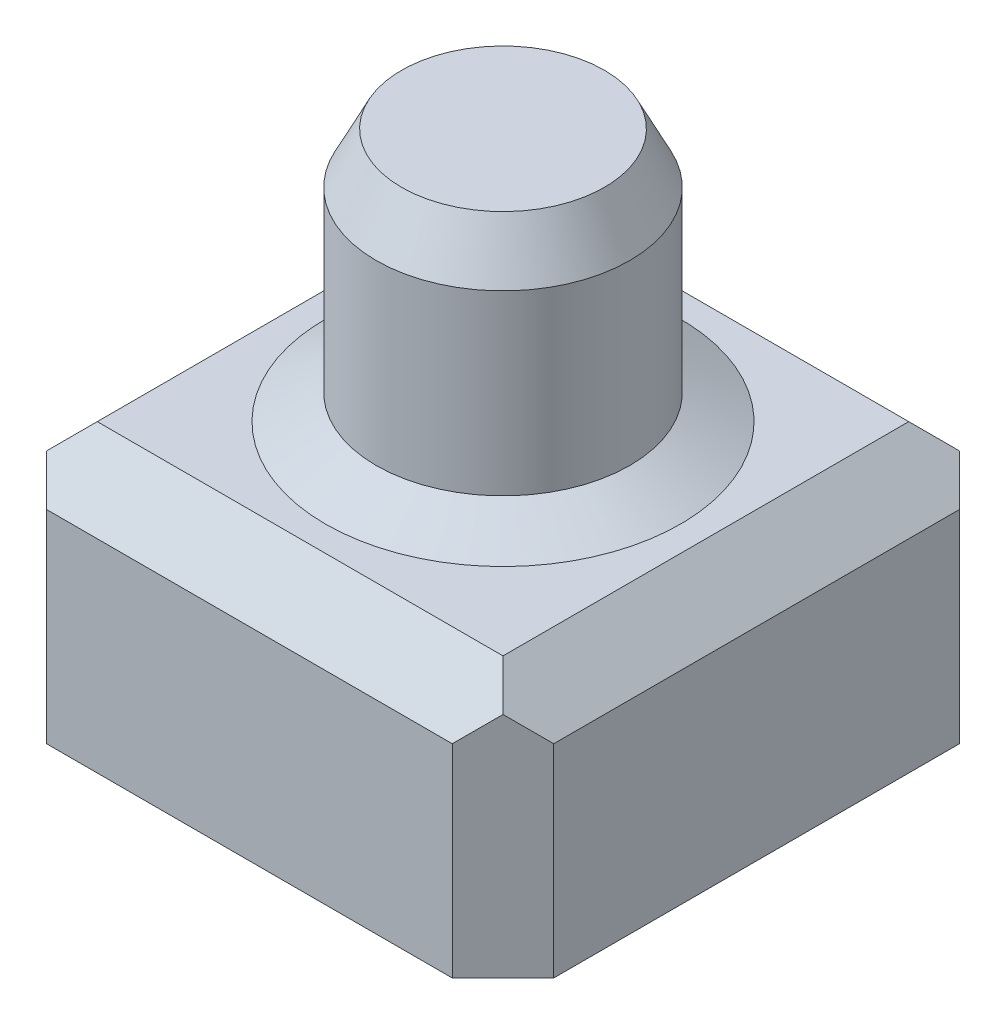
ISO-10303-21;
HEADER;
FILE_DESCRIPTION(('STEP AP214'),'2;1');
FILE_NAME('part.step','',(''),(''),'','','');
FILE_SCHEMA(('AUTOMOTIVE_DESIGN { 1 0 10303 214 1 1 1 1 }'));
ENDSEC;
DATA;
#1=APPLICATION_CONTEXT('core data for automotive mechanical design processes');
#2=APPLICATION_PROTOCOL_DEFINITION('international standard','automotive_design',2000,#1);
#3=PRODUCT_CONTEXT('',#1,'mechanical');
#4=PRODUCT('Part','Part','',(#3));
#5=PRODUCT_RELATED_PRODUCT_CATEGORY('part','',(#4));
#6=PRODUCT_DEFINITION_FORMATION('','',#4);
#7=PRODUCT_DEFINITION_CONTEXT('part definition',#1,'design');
#8=PRODUCT_DEFINITION('design','',#6,#7);
#9=PRODUCT_DEFINITION_SHAPE('','',#8);
#10=(LENGTH_UNIT() NAMED_UNIT(*) SI_UNIT(.MILLI.,.METRE.));
#11=(NAMED_UNIT(*) PLANE_ANGLE_UNIT() SI_UNIT($,.RADIAN.));
#12=(NAMED_UNIT(*) SI_UNIT($,.STERADIAN.) SOLID_ANGLE_UNIT());
#13=UNCERTAINTY_MEASURE_WITH_UNIT(LENGTH_MEASURE(1.E-05),#10,'distance_accuracy_value','');
#14=(GEOMETRIC_REPRESENTATION_CONTEXT(3) GLOBAL_UNCERTAINTY_ASSIGNED_CONTEXT((#13)) GLOBAL_UNIT_ASSIGNED_CONTEXT((#10,
#11,#12)) REPRESENTATION_CONTEXT('',''));
#15=CARTESIAN_POINT('',(0.,0.,0.));
#16=DIRECTION('',(0.,0.,1.));
#17=DIRECTION('',(1.,0.,0.));
#18=AXIS2_PLACEMENT_3D('',#15,#16,#17);
#19=CARTESIAN_POINT('',(0.,50.,0.));
#20=DIRECTION('',(0.,1.,0.));
#21=DIRECTION('',(0.,0.,1.));
#22=AXIS2_PLACEMENT_3D('',#19,#20,#21);
#23=PLANE('',#22);
#24=DIRECTION('',(-1.,0.,0.));
#25=VECTOR('',#24,1.);
#26=CARTESIAN_POINT('',(-89.9999999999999,50.,-90.));
#27=LINE('',#26,#25);
#28=CARTESIAN_POINT('',(-10.,50.,-90.));
#29=VERTEX_POINT('',#28);
#30=CARTESIAN_POINT('',(-90.,50.,-90.));
#31=VERTEX_POINT('',#30);
#32=EDGE_CURVE('E191',#29,#31,#27,.T.);
#33=ORIENTED_EDGE('',*,*,#32,.T.);
#34=DIRECTION('',(0.,0.,1.));
#35=VECTOR('',#34,1.);
#36=CARTESIAN_POINT('',(-90.,50.,-10.0000000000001));
#37=LINE('',#36,#35);
#38=CARTESIAN_POINT('',(-90.,50.,-10.));
#39=VERTEX_POINT('',#38);
#40=EDGE_CURVE('E193',#31,#39,#37,.T.);
#41=ORIENTED_EDGE('',*,*,#40,.T.);
#42=DIRECTION('',(1.,0.,0.));
#43=VECTOR('',#42,1.);
#44=CARTESIAN_POINT('',(-10.,50.,-10.));
#45=LINE('',#44,#43);
#46=CARTESIAN_POINT('',(-10.,50.,-10.));
#47=VERTEX_POINT('',#46);
#48=EDGE_CURVE('E187',#39,#47,#45,.T.);
#49=ORIENTED_EDGE('',*,*,#48,.T.);
#50=DIRECTION('',(0.,0.,-1.));
#51=VECTOR('',#50,1.);
#52=CARTESIAN_POINT('',(-10.,50.,-90.));
#53=LINE('',#52,#51);
#54=EDGE_CURVE('E189',#47,#29,#53,.T.);
#55=ORIENTED_EDGE('',*,*,#54,.T.);
#56=EDGE_LOOP('',(#33,#41,#49,#55));
#57=FACE_BOUND('',#56,.T.);
#58=CARTESIAN_POINT('',(-50.,50.,-50.));
#59=DIRECTION('',(0.,1.,0.));
#60=DIRECTION('',(0.,0.,1.));
#61=AXIS2_PLACEMENT_3D('',#58,#59,#60);
#62=CIRCLE('',#61,34.9999999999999);
#63=CARTESIAN_POINT('',(-50.,50.,-15.0000000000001));
#64=VERTEX_POINT('',#63);
#65=EDGE_CURVE('E181',#64,#64,#62,.F.);
#66=ORIENTED_EDGE('',*,*,#65,.T.);
#67=EDGE_LOOP('',(#66));
#68=FACE_BOUND('',#67,.T.);
#69=ADVANCED_FACE('F33',(#57,#68),#23,.T.);
#70=CARTESIAN_POINT('',(0.,50.,0.));
#71=DIRECTION('',(-1.,0.,0.));
#72=DIRECTION('',(0.,0.,1.));
#73=AXIS2_PLACEMENT_3D('',#70,#71,#72);
#74=PLANE('',#73);
#75=DIRECTION('',(0.,1.,0.));
#76=VECTOR('',#75,1.);
#77=CARTESIAN_POINT('',(0.,50.,-90.));
#78=LINE('',#77,#76);
#79=CARTESIAN_POINT('',(0.,0.,-90.));
#80=VERTEX_POINT('',#79);
#81=CARTESIAN_POINT('',(0.,40.,-90.));
#82=VERTEX_POINT('',#81);
#83=EDGE_CURVE('E129',#80,#82,#78,.T.);
#84=ORIENTED_EDGE('',*,*,#83,.T.);
#85=DIRECTION('',(0.,0.,1.));
#86=VECTOR('',#85,1.);
#87=CARTESIAN_POINT('',(0.,40.,-9.99999999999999));
#88=LINE('',#87,#86);
#89=CARTESIAN_POINT('',(0.,40.,-9.99999999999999));
#90=VERTEX_POINT('',#89);
#91=EDGE_CURVE('E127',#82,#90,#88,.T.);
#92=ORIENTED_EDGE('',*,*,#91,.T.);
#93=DIRECTION('',(0.,-1.,0.));
#94=VECTOR('',#93,1.);
#95=CARTESIAN_POINT('',(0.,50.,-9.99999999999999));
#96=LINE('',#95,#94);
#97=CARTESIAN_POINT('',(0.,0.,-9.99999999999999));
#98=VERTEX_POINT('',#97);
#99=EDGE_CURVE('E120',#90,#98,#96,.T.);
#100=ORIENTED_EDGE('',*,*,#99,.T.);
#101=DIRECTION('',(0.,0.,-1.));
#102=VECTOR('',#101,1.);
#103=CARTESIAN_POINT('',(0.,0.,0.));
#104=LINE('',#103,#102);
#105=EDGE_CURVE('E124',#98,#80,#104,.T.);
#106=ORIENTED_EDGE('',*,*,#105,.T.);
#107=EDGE_LOOP('',(#84,#92,#100,#106));
#108=FACE_BOUND('',#107,.T.);
#109=ADVANCED_FACE('F35',(#108),#74,.F.);
#110=CARTESIAN_POINT('',(0.,50.,-100.));
#111=DIRECTION('',(0.,0.,1.));
#112=DIRECTION('',(1.,0.,0.));
#113=AXIS2_PLACEMENT_3D('',#110,#111,#112);
#114=PLANE('',#113);
#115=DIRECTION('',(0.,1.,0.));
#116=VECTOR('',#115,1.);
#117=CARTESIAN_POINT('',(-90.,50.,-100.));
#118=LINE('',#117,#116);
#119=CARTESIAN_POINT('',(-90.,0.,-100.));
#120=VERTEX_POINT('',#119);
#121=CARTESIAN_POINT('',(-90.,40.,-100.));
#122=VERTEX_POINT('',#121);
#123=EDGE_CURVE('E165',#120,#122,#118,.T.);
#124=ORIENTED_EDGE('',*,*,#123,.T.);
#125=DIRECTION('',(1.,0.,0.));
#126=VECTOR('',#125,1.);
#127=CARTESIAN_POINT('',(-9.99999999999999,40.,-100.));
#128=LINE('',#127,#126);
#129=CARTESIAN_POINT('',(-9.99999999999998,40.,-100.));
#130=VERTEX_POINT('',#129);
#131=EDGE_CURVE('E207',#122,#130,#128,.T.);
#132=ORIENTED_EDGE('',*,*,#131,.T.);
#133=DIRECTION('',(0.,-1.,0.));
#134=VECTOR('',#133,1.);
#135=CARTESIAN_POINT('',(-9.99999999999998,50.,-100.));
#136=LINE('',#135,#134);
#137=CARTESIAN_POINT('',(-9.99999999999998,0.,-100.));
#138=VERTEX_POINT('',#137);
#139=EDGE_CURVE('E168',#130,#138,#136,.T.);
#140=ORIENTED_EDGE('',*,*,#139,.T.);
#141=DIRECTION('',(-1.,0.,0.));
#142=VECTOR('',#141,1.);
#143=CARTESIAN_POINT('',(0.,0.,-100.));
#144=LINE('',#143,#142);
#145=EDGE_CURVE('E143',#138,#120,#144,.T.);
#146=ORIENTED_EDGE('',*,*,#145,.T.);
#147=EDGE_LOOP('',(#124,#132,#140,#146));
#148=FACE_BOUND('',#147,.T.);
#149=ADVANCED_FACE('F264',(#148),#114,.F.);
#150=CARTESIAN_POINT('',(-100.,50.,0.));
#151=DIRECTION('',(1.,0.,0.));
#152=DIRECTION('',(0.,0.,-1.));
#153=AXIS2_PLACEMENT_3D('',#150,#151,#152);
#154=PLANE('',#153);
#155=DIRECTION('',(0.,1.,0.));
#156=VECTOR('',#155,1.);
#157=CARTESIAN_POINT('',(-100.,50.,-10.0000000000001));
#158=LINE('',#157,#156);
#159=CARTESIAN_POINT('',(-100.,0.,-10.0000000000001));
#160=VERTEX_POINT('',#159);
#161=CARTESIAN_POINT('',(-100.,40.,-10.0000000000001));
#162=VERTEX_POINT('',#161);
#163=EDGE_CURVE('E170',#160,#162,#158,.T.);
#164=ORIENTED_EDGE('',*,*,#163,.T.);
#165=DIRECTION('',(0.,0.,-1.));
#166=VECTOR('',#165,1.);
#167=CARTESIAN_POINT('',(-100.,40.,-90.));
#168=LINE('',#167,#166);
#169=CARTESIAN_POINT('',(-100.,40.,-90.));
#170=VERTEX_POINT('',#169);
#171=EDGE_CURVE('E200',#162,#170,#168,.T.);
#172=ORIENTED_EDGE('',*,*,#171,.T.);
#173=DIRECTION('',(0.,-1.,0.));
#174=VECTOR('',#173,1.);
#175=CARTESIAN_POINT('',(-100.,50.,-90.));
#176=LINE('',#175,#174);
#177=CARTESIAN_POINT('',(-100.,0.,-90.));
#178=VERTEX_POINT('',#177);
#179=EDGE_CURVE('E173',#170,#178,#176,.T.);
#180=ORIENTED_EDGE('',*,*,#179,.T.);
#181=DIRECTION('',(0.,0.,1.));
#182=VECTOR('',#181,1.);
#183=CARTESIAN_POINT('',(-100.,0.,0.));
#184=LINE('',#183,#182);
#185=EDGE_CURVE('E147',#178,#160,#184,.T.);
#186=ORIENTED_EDGE('',*,*,#185,.T.);
#187=EDGE_LOOP('',(#164,#172,#180,#186));
#188=FACE_BOUND('',#187,.T.);
#189=ADVANCED_FACE('F257',(#188),#154,.F.);
#190=CARTESIAN_POINT('',(0.,50.,0.));
#191=DIRECTION('',(0.,0.,-1.));
#192=DIRECTION('',(-1.,0.,0.));
#193=AXIS2_PLACEMENT_3D('',#190,#191,#192);
#194=PLANE('',#193);
#195=DIRECTION('',(0.,1.,0.));
#196=VECTOR('',#195,1.);
#197=CARTESIAN_POINT('',(-10.,50.,0.));
#198=LINE('',#197,#196);
#199=CARTESIAN_POINT('',(-10.,0.,0.));
#200=VERTEX_POINT('',#199);
#201=CARTESIAN_POINT('',(-10.,40.,0.));
#202=VERTEX_POINT('',#201);
#203=EDGE_CURVE('E133',#200,#202,#198,.T.);
#204=ORIENTED_EDGE('',*,*,#203,.T.);
#205=DIRECTION('',(-1.,0.,0.));
#206=VECTOR('',#205,1.);
#207=CARTESIAN_POINT('',(-90.,40.,0.));
#208=LINE('',#207,#206);
#209=CARTESIAN_POINT('',(-90.,40.,0.));
#210=VERTEX_POINT('',#209);
#211=EDGE_CURVE('E11',#202,#210,#208,.T.);
#212=ORIENTED_EDGE('',*,*,#211,.T.);
#213=DIRECTION('',(0.,-1.,0.));
#214=VECTOR('',#213,1.);
#215=CARTESIAN_POINT('',(-90.,50.,0.));
#216=LINE('',#215,#214);
#217=CARTESIAN_POINT('',(-90.,0.,0.));
#218=VERTEX_POINT('',#217);
#219=EDGE_CURVE('E137',#210,#218,#216,.T.);
#220=ORIENTED_EDGE('',*,*,#219,.T.);
#221=DIRECTION('',(1.,0.,0.));
#222=VECTOR('',#221,1.);
#223=CARTESIAN_POINT('',(0.,0.,0.));
#224=LINE('',#223,#222);
#225=EDGE_CURVE('E156',#218,#200,#224,.T.);
#226=ORIENTED_EDGE('',*,*,#225,.T.);
#227=EDGE_LOOP('',(#204,#212,#220,#226));
#228=FACE_BOUND('',#227,.T.);
#229=ADVANCED_FACE('F254',(#228),#194,.F.);
#230=CARTESIAN_POINT('',(0.,0.,0.));
#231=DIRECTION('',(0.,1.,0.));
#232=DIRECTION('',(0.,0.,1.));
#233=AXIS2_PLACEMENT_3D('',#230,#231,#232);
#234=PLANE('',#233);
#235=ORIENTED_EDGE('',*,*,#105,.F.);
#236=DIRECTION('',(0.707106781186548,0.,-0.707106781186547));
#237=VECTOR('',#236,1.);
#238=CARTESIAN_POINT('',(0.,0.,-9.99999999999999));
#239=LINE('',#238,#237);
#240=EDGE_CURVE('E131',#98,#200,#239,.F.);
#241=ORIENTED_EDGE('',*,*,#240,.T.);
#242=ORIENTED_EDGE('',*,*,#225,.F.);
#243=DIRECTION('',(0.707106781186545,0.,0.70710678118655));
#244=VECTOR('',#243,1.);
#245=CARTESIAN_POINT('',(-90.,0.,0.));
#246=LINE('',#245,#244);
#247=EDGE_CURVE('E128',#218,#160,#246,.F.);
#248=ORIENTED_EDGE('',*,*,#247,.T.);
#249=ORIENTED_EDGE('',*,*,#185,.F.);
#250=DIRECTION('',(-0.707106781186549,0.,0.707106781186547));
#251=VECTOR('',#250,1.);
#252=CARTESIAN_POINT('',(-100.,0.,-90.));
#253=LINE('',#252,#251);
#254=EDGE_CURVE('E160',#178,#120,#253,.F.);
#255=ORIENTED_EDGE('',*,*,#254,.T.);
#256=ORIENTED_EDGE('',*,*,#145,.F.);
#257=DIRECTION('',(-0.707106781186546,0.,-0.707106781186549));
#258=VECTOR('',#257,1.);
#259=CARTESIAN_POINT('',(-9.99999999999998,0.,-100.));
#260=LINE('',#259,#258);
#261=EDGE_CURVE('E138',#138,#80,#260,.F.);
#262=ORIENTED_EDGE('',*,*,#261,.T.);
#263=EDGE_LOOP('',(#235,#241,#242,#248,#249,#255,#256,#262));
#264=FACE_BOUND('',#263,.T.);
#265=ADVANCED_FACE('F140',(#264),#234,.F.);
#266=CARTESIAN_POINT('',(-50.,100.,-50.));
#267=DIRECTION('',(0.,-1.,0.));
#268=DIRECTION('',(0.,0.,-1.));
#269=AXIS2_PLACEMENT_3D('',#266,#267,#268);
#270=CYLINDRICAL_SURFACE('',#269,25.);
#271=CARTESIAN_POINT('',(-50.,55.,-50.));
#272=DIRECTION('',(0.,1.,0.));
#273=DIRECTION('',(0.,0.,1.));
#274=AXIS2_PLACEMENT_3D('',#271,#272,#273);
#275=CIRCLE('',#274,25.);
#276=CARTESIAN_POINT('',(-50.,55.,-25.));
#277=VERTEX_POINT('',#276);
#278=EDGE_CURVE('E178',#277,#277,#275,.T.);
#279=ORIENTED_EDGE('',*,*,#278,.T.);
#280=EDGE_LOOP('',(#279));
#281=FACE_BOUND('',#280,.T.);
#282=CARTESIAN_POINT('',(-50.,89.9999999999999,-50.));
#283=DIRECTION('',(0.,1.,0.));
#284=DIRECTION('',(0.,0.,1.));
#285=AXIS2_PLACEMENT_3D('',#282,#283,#284);
#286=CIRCLE('',#285,25.);
#287=CARTESIAN_POINT('',(-50.,89.9999999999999,-75.));
#288=VERTEX_POINT('',#287);
#289=EDGE_CURVE('E175',#288,#288,#286,.F.);
#290=ORIENTED_EDGE('',*,*,#289,.T.);
#291=EDGE_LOOP('',(#290));
#292=FACE_BOUND('',#291,.T.);
#293=ADVANCED_FACE('F282',(#281,#292),#270,.T.);
#294=CARTESIAN_POINT('',(-50.,100.,-50.));
#295=DIRECTION('',(0.,1.,0.));
#296=DIRECTION('',(0.,0.,1.));
#297=AXIS2_PLACEMENT_3D('',#294,#295,#296);
#298=PLANE('',#297);
#299=CARTESIAN_POINT('',(-50.,100.,-50.));
#300=DIRECTION('',(0.,1.,0.));
#301=DIRECTION('',(0.,0.,1.));
#302=AXIS2_PLACEMENT_3D('',#299,#300,#301);
#303=CIRCLE('',#302,20.);
#304=CARTESIAN_POINT('',(-50.,100.,-70.));
#305=VERTEX_POINT('',#304);
#306=EDGE_CURVE('E184',#305,#305,#303,.T.);
#307=ORIENTED_EDGE('',*,*,#306,.T.);
#308=EDGE_LOOP('',(#307));
#309=FACE_BOUND('',#308,.T.);
#310=ADVANCED_FACE('F286',(#309),#298,.T.);
#311=CARTESIAN_POINT('',(0.,50.,-9.99999999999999));
#312=DIRECTION('',(-0.707106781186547,0.,-0.707106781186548));
#313=DIRECTION('',(-0.707106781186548,0.,0.707106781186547));
#314=AXIS2_PLACEMENT_3D('',#311,#312,#313);
#315=PLANE('',#314);
#316=ORIENTED_EDGE('',*,*,#99,.F.);
#317=DIRECTION('',(0.577350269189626,-0.577350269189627,-0.577350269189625));
#318=VECTOR('',#317,1.);
#319=CARTESIAN_POINT('',(-3.33333333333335,43.3333333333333,-6.66666666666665));
#320=LINE('',#319,#318);
#321=CARTESIAN_POINT('',(-5.,45.,-5.));
#322=VERTEX_POINT('',#321);
#323=EDGE_CURVE('E41',#90,#322,#320,.F.);
#324=ORIENTED_EDGE('',*,*,#323,.T.);
#325=DIRECTION('',(0.577350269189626,0.577350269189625,-0.577350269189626));
#326=VECTOR('',#325,1.);
#327=CARTESIAN_POINT('',(0.,50.,-10.));
#328=LINE('',#327,#326);
#329=EDGE_CURVE('E52',#322,#202,#328,.F.);
#330=ORIENTED_EDGE('',*,*,#329,.T.);
#331=ORIENTED_EDGE('',*,*,#203,.F.);
#332=ORIENTED_EDGE('',*,*,#240,.F.);
#333=EDGE_LOOP('',(#316,#324,#330,#331,#332));
#334=FACE_BOUND('',#333,.T.);
#335=ADVANCED_FACE('F132',(#334),#315,.F.);
#336=CARTESIAN_POINT('',(-9.99999999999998,50.,-100.));
#337=DIRECTION('',(-0.707106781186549,0.,0.707106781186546));
#338=DIRECTION('',(0.707106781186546,0.,0.707106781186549));
#339=AXIS2_PLACEMENT_3D('',#336,#337,#338);
#340=PLANE('',#339);
#341=ORIENTED_EDGE('',*,*,#139,.F.);
#342=DIRECTION('',(-0.577350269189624,-0.577350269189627,-0.577350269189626));
#343=VECTOR('',#342,1.);
#344=CARTESIAN_POINT('',(-6.66666666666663,43.3333333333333,-96.6666666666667));
#345=LINE('',#344,#343);
#346=CARTESIAN_POINT('',(-4.99999999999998,45.,-95.));
#347=VERTEX_POINT('',#346);
#348=EDGE_CURVE('E211',#130,#347,#345,.F.);
#349=ORIENTED_EDGE('',*,*,#348,.T.);
#350=DIRECTION('',(-0.577350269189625,0.577350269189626,-0.577350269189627));
#351=VECTOR('',#350,1.);
#352=CARTESIAN_POINT('',(-9.99999999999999,50.,-100.));
#353=LINE('',#352,#351);
#354=EDGE_CURVE('E209',#347,#82,#353,.F.);
#355=ORIENTED_EDGE('',*,*,#354,.T.);
#356=ORIENTED_EDGE('',*,*,#83,.F.);
#357=ORIENTED_EDGE('',*,*,#261,.F.);
#358=EDGE_LOOP('',(#341,#349,#355,#356,#357));
#359=FACE_BOUND('',#358,.T.);
#360=ADVANCED_FACE('F218',(#359),#340,.F.);
#361=CARTESIAN_POINT('',(-100.,50.,-90.));
#362=DIRECTION('',(0.707106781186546,0.,0.707106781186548));
#363=DIRECTION('',(0.707106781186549,0.,-0.707106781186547));
#364=AXIS2_PLACEMENT_3D('',#361,#362,#363);
#365=PLANE('',#364);
#366=ORIENTED_EDGE('',*,*,#179,.F.);
#367=DIRECTION('',(-0.577350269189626,-0.577350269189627,0.577350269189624));
#368=VECTOR('',#367,1.);
#369=CARTESIAN_POINT('',(-96.6666666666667,43.3333333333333,-93.3333333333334));
#370=LINE('',#369,#368);
#371=CARTESIAN_POINT('',(-95.,45.,-95.));
#372=VERTEX_POINT('',#371);
#373=EDGE_CURVE('E205',#170,#372,#370,.F.);
#374=ORIENTED_EDGE('',*,*,#373,.T.);
#375=DIRECTION('',(-0.577350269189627,0.577350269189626,0.577350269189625));
#376=VECTOR('',#375,1.);
#377=CARTESIAN_POINT('',(-100.,50.,-90.));
#378=LINE('',#377,#376);
#379=EDGE_CURVE('E203',#372,#122,#378,.F.);
#380=ORIENTED_EDGE('',*,*,#379,.T.);
#381=ORIENTED_EDGE('',*,*,#123,.F.);
#382=ORIENTED_EDGE('',*,*,#254,.F.);
#383=EDGE_LOOP('',(#366,#374,#380,#381,#382));
#384=FACE_BOUND('',#383,.T.);
#385=ADVANCED_FACE('F262',(#384),#365,.F.);
#386=CARTESIAN_POINT('',(-90.,50.,0.));
#387=DIRECTION('',(0.70710678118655,0.,-0.707106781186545));
#388=DIRECTION('',(-0.707106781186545,0.,-0.70710678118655));
#389=AXIS2_PLACEMENT_3D('',#386,#387,#388);
#390=PLANE('',#389);
#391=DIRECTION('',(0.577350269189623,-0.577350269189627,0.577350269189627));
#392=VECTOR('',#391,1.);
#393=CARTESIAN_POINT('',(-93.3333333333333,43.3333333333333,-3.33333333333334));
#394=LINE('',#393,#392);
#395=CARTESIAN_POINT('',(-95.,45.,-4.99999999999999));
#396=VERTEX_POINT('',#395);
#397=EDGE_CURVE('E196',#210,#396,#394,.F.);
#398=ORIENTED_EDGE('',*,*,#397,.T.);
#399=DIRECTION('',(0.577350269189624,0.577350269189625,0.577350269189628));
#400=VECTOR('',#399,1.);
#401=CARTESIAN_POINT('',(-90.,50.,0.));
#402=LINE('',#401,#400);
#403=EDGE_CURVE('E198',#396,#162,#402,.F.);
#404=ORIENTED_EDGE('',*,*,#403,.T.);
#405=ORIENTED_EDGE('',*,*,#163,.F.);
#406=ORIENTED_EDGE('',*,*,#247,.F.);
#407=ORIENTED_EDGE('',*,*,#219,.F.);
#408=EDGE_LOOP('',(#398,#404,#405,#406,#407));
#409=FACE_BOUND('',#408,.T.);
#410=ADVANCED_FACE('F250',(#409),#390,.F.);
#411=CARTESIAN_POINT('',(-50.,55.,-50.));
#412=DIRECTION('',(0.,-1.,0.));
#413=DIRECTION('',(0.,0.,-1.));
#414=AXIS2_PLACEMENT_3D('',#411,#412,#413);
#415=CONICAL_SURFACE('',#414,25.,1.10714871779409);
#416=ORIENTED_EDGE('',*,*,#65,.F.);
#417=EDGE_LOOP('',(#416));
#418=FACE_BOUND('',#417,.T.);
#419=ORIENTED_EDGE('',*,*,#278,.F.);
#420=EDGE_LOOP('',(#419));
#421=FACE_BOUND('',#420,.T.);
#422=ADVANCED_FACE('F303',(#418,#421),#415,.T.);
#423=CARTESIAN_POINT('',(-50.,100.,-50.));
#424=DIRECTION('',(0.,-1.,0.));
#425=DIRECTION('',(0.,0.,-1.));
#426=AXIS2_PLACEMENT_3D('',#423,#424,#425);
#427=CONICAL_SURFACE('',#426,20.,0.463647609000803);
#428=CARTESIAN_POINT('',(-50.,89.9999999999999,-75.));
#429=CARTESIAN_POINT('',(-50.,90.1041666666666,-74.9479166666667));
#430=CARTESIAN_POINT('',(-50.,90.2083333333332,-74.8958333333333));
#431=CARTESIAN_POINT('',(-50.,90.4166666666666,-74.7916666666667));
#432=CARTESIAN_POINT('',(-50.,90.5208333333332,-74.7395833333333));
#433=CARTESIAN_POINT('',(-50.,90.7291666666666,-74.6354166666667));
#434=CARTESIAN_POINT('',(-50.,90.8333333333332,-74.5833333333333));
#435=CARTESIAN_POINT('',(-50.,91.0416666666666,-74.4791666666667));
#436=CARTESIAN_POINT('',(-50.,91.1458333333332,-74.4270833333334));
#437=CARTESIAN_POINT('',(-50.,91.3541666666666,-74.3229166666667));
#438=CARTESIAN_POINT('',(-50.,91.4583333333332,-74.2708333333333));
#439=CARTESIAN_POINT('',(-50.,91.6666666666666,-74.1666666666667));
#440=CARTESIAN_POINT('',(-50.,91.7708333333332,-74.1145833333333));
#441=CARTESIAN_POINT('',(-50.,91.9791666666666,-74.0104166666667));
#442=CARTESIAN_POINT('',(-50.,92.0833333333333,-73.9583333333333));
#443=CARTESIAN_POINT('',(-50.,92.2916666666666,-73.8541666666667));
#444=CARTESIAN_POINT('',(-50.,92.3958333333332,-73.8020833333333));
#445=CARTESIAN_POINT('',(-50.,92.6041666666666,-73.6979166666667));
#446=CARTESIAN_POINT('',(-50.,92.7083333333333,-73.6458333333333));
#447=CARTESIAN_POINT('',(-50.,92.9166666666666,-73.5416666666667));
#448=CARTESIAN_POINT('',(-50.,93.0208333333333,-73.4895833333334));
#449=CARTESIAN_POINT('',(-50.,93.2291666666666,-73.3854166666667));
#450=CARTESIAN_POINT('',(-50.,93.3333333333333,-73.3333333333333));
#451=CARTESIAN_POINT('',(-50.,93.5416666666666,-73.2291666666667));
#452=CARTESIAN_POINT('',(-50.,93.6458333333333,-73.1770833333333));
#453=CARTESIAN_POINT('',(-50.,93.8541666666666,-73.0729166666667));
#454=CARTESIAN_POINT('',(-50.,93.9583333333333,-73.0208333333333));
#455=CARTESIAN_POINT('',(-50.,94.1666666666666,-72.9166666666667));
#456=CARTESIAN_POINT('',(-50.,94.2708333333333,-72.8645833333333));
#457=CARTESIAN_POINT('',(-50.,94.4791666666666,-72.7604166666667));
#458=CARTESIAN_POINT('',(-50.,94.5833333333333,-72.7083333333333));
#459=CARTESIAN_POINT('',(-50.,94.7916666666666,-72.6041666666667));
#460=CARTESIAN_POINT('',(-50.,94.8958333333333,-72.5520833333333));
#461=CARTESIAN_POINT('',(-50.,95.1041666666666,-72.4479166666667));
#462=CARTESIAN_POINT('',(-50.,95.2083333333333,-72.3958333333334));
#463=CARTESIAN_POINT('',(-50.,95.4166666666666,-72.2916666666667));
#464=CARTESIAN_POINT('',(-50.,95.5208333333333,-72.2395833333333));
#465=CARTESIAN_POINT('',(-50.,95.7291666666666,-72.1354166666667));
#466=CARTESIAN_POINT('',(-50.,95.8333333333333,-72.0833333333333));
#467=CARTESIAN_POINT('',(-50.,96.0416666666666,-71.9791666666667));
#468=CARTESIAN_POINT('',(-50.,96.1458333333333,-71.9270833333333));
#469=CARTESIAN_POINT('',(-50.,96.3541666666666,-71.8229166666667));
#470=CARTESIAN_POINT('',(-50.,96.4583333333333,-71.7708333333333));
#471=CARTESIAN_POINT('',(-50.,96.6666666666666,-71.6666666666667));
#472=CARTESIAN_POINT('',(-50.,96.7708333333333,-71.6145833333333));
#473=CARTESIAN_POINT('',(-50.,96.9791666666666,-71.5104166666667));
#474=CARTESIAN_POINT('',(-50.,97.0833333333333,-71.4583333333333));
#475=CARTESIAN_POINT('',(-50.,97.2916666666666,-71.3541666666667));
#476=CARTESIAN_POINT('',(-50.,97.3958333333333,-71.3020833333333));
#477=CARTESIAN_POINT('',(-50.,97.6041666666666,-71.1979166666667));
#478=CARTESIAN_POINT('',(-50.,97.7083333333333,-71.1458333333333));
#479=CARTESIAN_POINT('',(-50.,97.9166666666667,-71.0416666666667));
#480=CARTESIAN_POINT('',(-50.,98.0208333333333,-70.9895833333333));
#481=CARTESIAN_POINT('',(-50.,98.2291666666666,-70.8854166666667));
#482=CARTESIAN_POINT('',(-50.,98.3333333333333,-70.8333333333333));
#483=CARTESIAN_POINT('',(-50.,98.5416666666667,-70.7291666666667));
#484=CARTESIAN_POINT('',(-50.,98.6458333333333,-70.6770833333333));
#485=CARTESIAN_POINT('',(-50.,98.8541666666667,-70.5729166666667));
#486=CARTESIAN_POINT('',(-50.,98.9583333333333,-70.5208333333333));
#487=CARTESIAN_POINT('',(-50.,99.1666666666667,-70.4166666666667));
#488=CARTESIAN_POINT('',(-50.,99.2708333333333,-70.3645833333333));
#489=CARTESIAN_POINT('',(-50.,99.4791666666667,-70.2604166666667));
#490=CARTESIAN_POINT('',(-50.,99.5833333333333,-70.2083333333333));
#491=CARTESIAN_POINT('',(-50.,99.7916666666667,-70.1041666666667));
#492=CARTESIAN_POINT('',(-50.,99.8958333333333,-70.0520833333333));
#493=CARTESIAN_POINT('',(-50.,100.,-70.));
#494=B_SPLINE_CURVE_WITH_KNOTS('',3,(#428,#429,#430,#431,#432,#433,#434,#435,#436,#437,#438,
#439,#440,#441,#442,#443,#444,#445,#446,#447,#448,#449,#450,#451,#452,#453,#454,#455,#456,#457,
#458,#459,#460,#461,#462,#463,#464,#465,#466,#467,#468,#469,#470,#471,#472,#473,#474,#475,#476,
#477,#478,#479,#480,#481,#482,#483,#484,#485,#486,#487,#488,#489,#490,#491,#492,#493),
.UNSPECIFIED.,.F.,.F.,(4,2,2,2,2,2,2,2,2,2,2,2,2,2,2,2,2,2,2,2,2,2,2,2,2,2,2,2,2,2,2,2,4),(0.,
0.349385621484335,0.698771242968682,1.04815686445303,1.39754248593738,1.74692810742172,
2.09631372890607,2.44569935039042,2.79508497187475,3.1444705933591,3.49385621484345,
3.84324183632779,4.19262745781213,4.54201307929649,4.89139870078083,5.24078432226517,
5.59016994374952,5.93955556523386,6.28894118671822,6.63832680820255,6.9877124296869,
7.33709805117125,7.68648367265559,8.03586929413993,8.38525491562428,8.73464053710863,
9.08402615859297,9.43341178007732,9.78279740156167,10.132183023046,10.4815686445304,
10.8309542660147,11.1803398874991),.UNSPECIFIED.);
#495=EDGE_CURVE('BSEAM306',#288,#305,#494,.T.);
#496=ORIENTED_EDGE('',*,*,#289,.F.);
#497=ORIENTED_EDGE('',*,*,#306,.F.);
#498=ORIENTED_EDGE('',*,*,#495,.T.);
#499=ORIENTED_EDGE('',*,*,#495,.F.);
#500=EDGE_LOOP('',(#496,#498,#497,#499));
#501=FACE_BOUND('',#500,.T.);
#502=ADVANCED_FACE('F306',(#501),#427,.T.);
#503=CARTESIAN_POINT('',(-10.,50.,0.));
#504=DIRECTION('',(0.707106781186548,0.707106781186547,0.));
#505=DIRECTION('',(-0.707106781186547,0.707106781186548,0.));
#506=AXIS2_PLACEMENT_3D('',#503,#504,#505);
#507=PLANE('',#506);
#508=ORIENTED_EDGE('',*,*,#91,.F.);
#509=ORIENTED_EDGE('',*,*,#354,.F.);
#510=DIRECTION('',(0.577350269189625,-0.577350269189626,-0.577350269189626));
#511=VECTOR('',#510,1.);
#512=CARTESIAN_POINT('',(-6.66666666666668,46.6666666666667,-93.3333333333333));
#513=LINE('',#512,#511);
#514=EDGE_CURVE('E144',#29,#347,#513,.T.);
#515=ORIENTED_EDGE('',*,*,#514,.F.);
#516=ORIENTED_EDGE('',*,*,#54,.F.);
#517=DIRECTION('',(0.577350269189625,-0.577350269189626,0.577350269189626));
#518=VECTOR('',#517,1.);
#519=CARTESIAN_POINT('',(-6.66666666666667,46.6666666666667,-6.66666666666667));
#520=LINE('',#519,#518);
#521=EDGE_CURVE('E150',#322,#47,#520,.F.);
#522=ORIENTED_EDGE('',*,*,#521,.F.);
#523=ORIENTED_EDGE('',*,*,#323,.F.);
#524=EDGE_LOOP('',(#508,#509,#515,#516,#522,#523));
#525=FACE_BOUND('',#524,.T.);
#526=ADVANCED_FACE('F223',(#525),#507,.T.);
#527=CARTESIAN_POINT('',(0.,50.,-90.));
#528=DIRECTION('',(0.,0.707106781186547,-0.707106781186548));
#529=DIRECTION('',(0.,0.707106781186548,0.707106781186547));
#530=AXIS2_PLACEMENT_3D('',#527,#528,#529);
#531=PLANE('',#530);
#532=ORIENTED_EDGE('',*,*,#131,.F.);
#533=ORIENTED_EDGE('',*,*,#379,.F.);
#534=DIRECTION('',(-0.577350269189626,-0.577350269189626,-0.577350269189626));
#535=VECTOR('',#534,1.);
#536=CARTESIAN_POINT('',(-60.,80.,-60.));
#537=LINE('',#536,#535);
#538=EDGE_CURVE('E230',#31,#372,#537,.T.);
#539=ORIENTED_EDGE('',*,*,#538,.F.);
#540=ORIENTED_EDGE('',*,*,#32,.F.);
#541=ORIENTED_EDGE('',*,*,#514,.T.);
#542=ORIENTED_EDGE('',*,*,#348,.F.);
#543=EDGE_LOOP('',(#532,#533,#539,#540,#541,#542));
#544=FACE_BOUND('',#543,.T.);
#545=ADVANCED_FACE('F226',(#544),#531,.T.);
#546=CARTESIAN_POINT('',(0.,50.,-10.));
#547=DIRECTION('',(0.,0.707106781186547,0.707106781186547));
#548=DIRECTION('',(0.,-0.707106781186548,0.707106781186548));
#549=AXIS2_PLACEMENT_3D('',#546,#547,#548);
#550=PLANE('',#549);
#551=ORIENTED_EDGE('',*,*,#521,.T.);
#552=ORIENTED_EDGE('',*,*,#48,.F.);
#553=DIRECTION('',(-0.577350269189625,-0.577350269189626,0.577350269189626));
#554=VECTOR('',#553,1.);
#555=CARTESIAN_POINT('',(-60.,80.,-40.));
#556=LINE('',#555,#554);
#557=EDGE_CURVE('E240',#396,#39,#556,.F.);
#558=ORIENTED_EDGE('',*,*,#557,.F.);
#559=ORIENTED_EDGE('',*,*,#397,.F.);
#560=ORIENTED_EDGE('',*,*,#211,.F.);
#561=ORIENTED_EDGE('',*,*,#329,.F.);
#562=EDGE_LOOP('',(#551,#552,#558,#559,#560,#561));
#563=FACE_BOUND('',#562,.T.);
#564=ADVANCED_FACE('F237',(#563),#550,.T.);
#565=CARTESIAN_POINT('',(-90.,50.,0.));
#566=DIRECTION('',(-0.707106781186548,0.707106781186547,0.));
#567=DIRECTION('',(-0.707106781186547,-0.707106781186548,0.));
#568=AXIS2_PLACEMENT_3D('',#565,#566,#567);
#569=PLANE('',#568);
#570=ORIENTED_EDGE('',*,*,#373,.F.);
#571=ORIENTED_EDGE('',*,*,#171,.F.);
#572=ORIENTED_EDGE('',*,*,#403,.F.);
#573=ORIENTED_EDGE('',*,*,#557,.T.);
#574=ORIENTED_EDGE('',*,*,#40,.F.);
#575=ORIENTED_EDGE('',*,*,#538,.T.);
#576=EDGE_LOOP('',(#570,#571,#572,#573,#574,#575));
#577=FACE_BOUND('',#576,.T.);
#578=ADVANCED_FACE('F245',(#577),#569,.T.);
#579=CLOSED_SHELL('',(#69,#109,#149,#189,#229,#265,#293,#310,#335,#360,#385,#410,#422,#502,#526,
#545,#564,#578));
#580=MANIFOLD_SOLID_BREP('B2',#579);
#581=ADVANCED_BREP_SHAPE_REPRESENTATION('',(#18,#580),#14);
#582=SHAPE_DEFINITION_REPRESENTATION(#9,#581);
ENDSEC;
END-ISO-10303-21;
